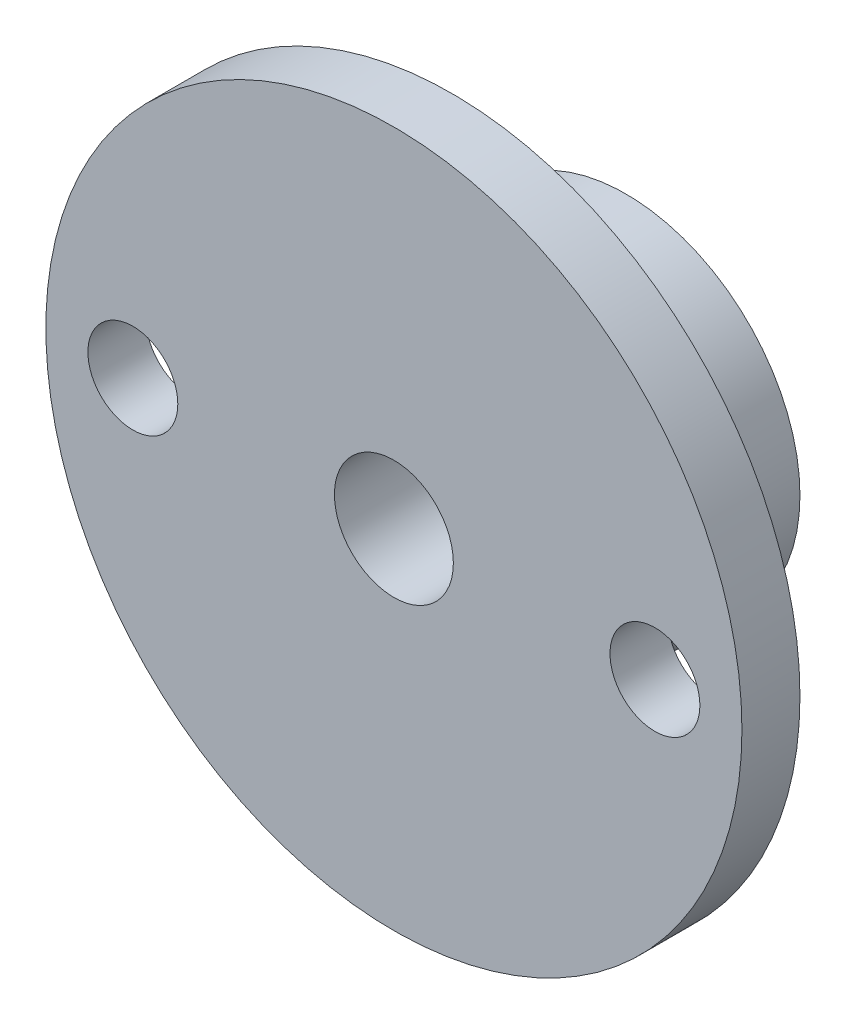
from build123d import *

# Parameters (mm, degrees)
ESQUISSE1_R             = 6
EXTRUSION1_DEPTH        = 6
ESQUISSE2_R             = 12
EXTRUSION2_DEPTH        = 2
ESQUISSE3_R             = 2.05
ENL_V_MAT_EXTRU_1_DEPTH = 19.761663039
ESQUISSE4_R             = 1.55
ENL_V_MAT_EXTRU_2_DEPTH = 19.761663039
ESQUISSE5_R             = 1.5
ENL_V_MAT_EXTRU_3_DEPTH = 10


with BuildPart() as part:
    # Esquisse1 → Extrusion1 (new body)
    with BuildSketch(Plane.XY):
        Circle(ESQUISSE1_R)
    extrude(amount=EXTRUSION1_DEPTH)

    # Esquisse2 → Extrusion2 (add)
    with BuildSketch(Plane.XY.offset(6)):
        Circle(ESQUISSE2_R)
    extrude(amount=EXTRUSION2_DEPTH)

    # Esquisse3 → Enl_v. mat.-Extru.1 (cut, through all)
    with BuildSketch(Plane.XY.offset(8)):
        Circle(ESQUISSE3_R)
    extrude(amount=-ENL_V_MAT_EXTRU_1_DEPTH, mode=Mode.SUBTRACT)

    # Esquisse4 → Enl_v. mat.-Extru.2 (cut, through all)
    with BuildSketch(Plane.XY.offset(8)):
        with Locations((-9, 0)):
            Circle(ESQUISSE4_R)
        with Locations((9, 0)):
            Circle(ESQUISSE4_R)
    extrude(amount=-ENL_V_MAT_EXTRU_2_DEPTH, mode=Mode.SUBTRACT)

    # Esquisse5 → Enl_v. mat.-Extru.3 (cut)
    with BuildSketch(Plane(origin=(0, 0, 0), x_dir=(1, 0, 0), z_dir=(0, 1, 0))):
        with Locations(Location((0, -3, 0), (0, 0, 270))):
            Circle(ESQUISSE5_R)
    extrude(amount=-ENL_V_MAT_EXTRU_3_DEPTH, mode=Mode.SUBTRACT)


solid = part.part
